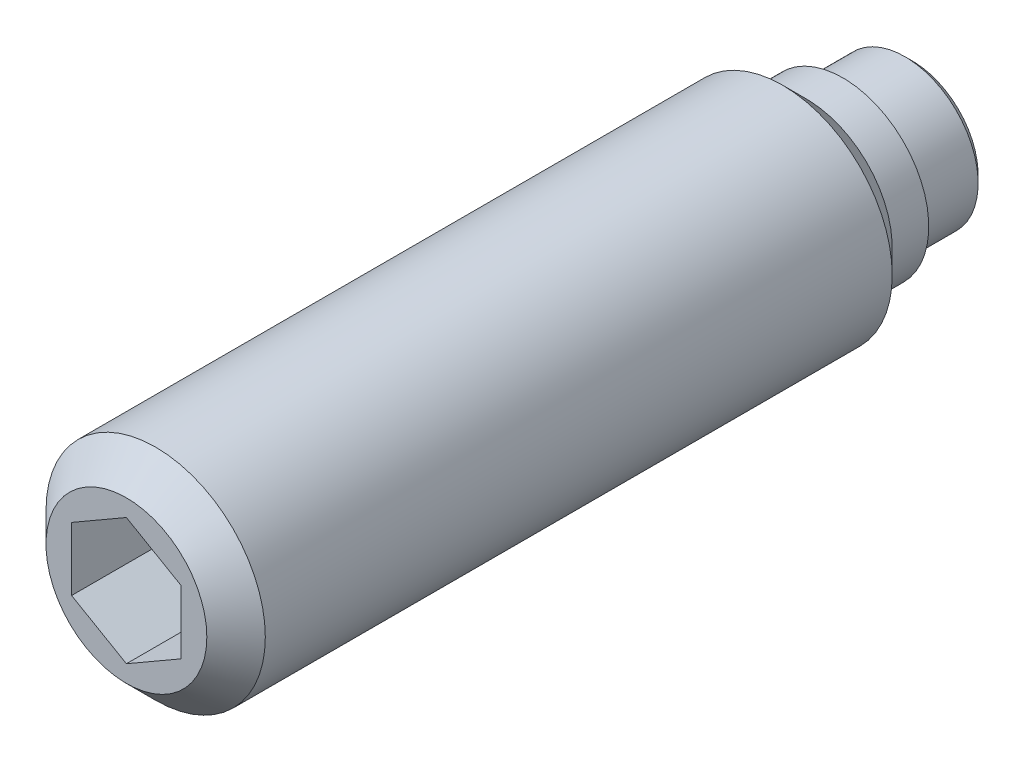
ISO-10303-21;
HEADER;
FILE_DESCRIPTION(('STEP AP214'),'2;1');
FILE_NAME('part.step','',(''),(''),'','','');
FILE_SCHEMA(('AUTOMOTIVE_DESIGN { 1 0 10303 214 1 1 1 1 }'));
ENDSEC;
DATA;
#1=APPLICATION_CONTEXT('core data for automotive mechanical design processes');
#2=APPLICATION_PROTOCOL_DEFINITION('international standard','automotive_design',2000,#1);
#3=PRODUCT_CONTEXT('',#1,'mechanical');
#4=PRODUCT('Part','Part','',(#3));
#5=PRODUCT_RELATED_PRODUCT_CATEGORY('part','',(#4));
#6=PRODUCT_DEFINITION_FORMATION('','',#4);
#7=PRODUCT_DEFINITION_CONTEXT('part definition',#1,'design');
#8=PRODUCT_DEFINITION('design','',#6,#7);
#9=PRODUCT_DEFINITION_SHAPE('','',#8);
#10=(LENGTH_UNIT() NAMED_UNIT(*) SI_UNIT(.MILLI.,.METRE.));
#11=(NAMED_UNIT(*) PLANE_ANGLE_UNIT() SI_UNIT($,.RADIAN.));
#12=(NAMED_UNIT(*) SI_UNIT($,.STERADIAN.) SOLID_ANGLE_UNIT());
#13=UNCERTAINTY_MEASURE_WITH_UNIT(LENGTH_MEASURE(1.E-05),#10,'distance_accuracy_value','');
#14=(GEOMETRIC_REPRESENTATION_CONTEXT(3) GLOBAL_UNCERTAINTY_ASSIGNED_CONTEXT((#13)) GLOBAL_UNIT_ASSIGNED_CONTEXT((#10,
#11,#12)) REPRESENTATION_CONTEXT('',''));
#15=CARTESIAN_POINT('',(0.,0.,0.));
#16=DIRECTION('',(0.,0.,1.));
#17=DIRECTION('',(1.,0.,0.));
#18=AXIS2_PLACEMENT_3D('',#15,#16,#17);
#19=CARTESIAN_POINT('',(0.,2.35,1.9));
#20=DIRECTION('',(0.,0.,1.));
#21=DIRECTION('',(1.,0.,0.));
#22=AXIS2_PLACEMENT_3D('',#19,#20,#21);
#23=PLANE('',#22);
#24=CARTESIAN_POINT('',(0.,0.,1.9));
#25=DIRECTION('',(0.,0.,-1.));
#26=DIRECTION('',(-1.,0.,0.));
#27=AXIS2_PLACEMENT_3D('',#24,#25,#26);
#28=CIRCLE('',#27,2.);
#29=CARTESIAN_POINT('',(-2.,0.,1.9));
#30=VERTEX_POINT('',#29);
#31=EDGE_CURVE('E130',#30,#30,#28,.T.);
#32=ORIENTED_EDGE('',*,*,#31,.F.);
#33=EDGE_LOOP('',(#32));
#34=FACE_BOUND('',#33,.T.);
#35=CARTESIAN_POINT('',(0.,0.,1.9));
#36=DIRECTION('',(0.,0.,-1.));
#37=DIRECTION('',(-1.,0.,0.));
#38=AXIS2_PLACEMENT_3D('',#35,#36,#37);
#39=CIRCLE('',#38,2.35);
#40=CARTESIAN_POINT('',(-2.35,0.,1.9));
#41=VERTEX_POINT('',#40);
#42=EDGE_CURVE('E133',#41,#41,#39,.T.);
#43=ORIENTED_EDGE('',*,*,#42,.T.);
#44=EDGE_LOOP('',(#43));
#45=FACE_BOUND('',#44,.T.);
#46=ADVANCED_FACE('F14',(#34,#45),#23,.F.);
#47=CARTESIAN_POINT('',(0.,0.,1.9));
#48=DIRECTION('',(0.,0.,-1.));
#49=DIRECTION('',(-1.,0.,0.));
#50=AXIS2_PLACEMENT_3D('',#47,#48,#49);
#51=CYLINDRICAL_SURFACE('',#50,3.);
#52=CARTESIAN_POINT('',(0.,0.,20.7));
#53=DIRECTION('',(0.,0.,1.));
#54=DIRECTION('',(1.,0.,0.));
#55=AXIS2_PLACEMENT_3D('',#52,#53,#54);
#56=CIRCLE('',#55,3.);
#57=CARTESIAN_POINT('',(3.,0.,20.7));
#58=VERTEX_POINT('',#57);
#59=EDGE_CURVE('E9',#58,#58,#56,.F.);
#60=ORIENTED_EDGE('',*,*,#59,.T.);
#61=EDGE_LOOP('',(#60));
#62=FACE_BOUND('',#61,.T.);
#63=CARTESIAN_POINT('',(0.,0.,3.55));
#64=DIRECTION('',(0.,0.,-1.));
#65=DIRECTION('',(-1.,0.,0.));
#66=AXIS2_PLACEMENT_3D('',#63,#64,#65);
#67=CIRCLE('',#66,3.);
#68=CARTESIAN_POINT('',(-3.,0.,3.55));
#69=VERTEX_POINT('',#68);
#70=EDGE_CURVE('E139',#69,#69,#67,.T.);
#71=ORIENTED_EDGE('',*,*,#70,.F.);
#72=EDGE_LOOP('',(#71));
#73=FACE_BOUND('',#72,.T.);
#74=ADVANCED_FACE('F157',(#62,#73),#51,.T.);
#75=CARTESIAN_POINT('',(0.,0.,3.55));
#76=DIRECTION('',(0.,0.,1.));
#77=DIRECTION('',(1.,0.,0.));
#78=AXIS2_PLACEMENT_3D('',#75,#76,#77);
#79=CONICAL_SURFACE('',#78,3.,0.785398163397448);
#80=CARTESIAN_POINT('',(0.,0.,2.9));
#81=DIRECTION('',(0.,0.,-1.));
#82=DIRECTION('',(-1.,0.,0.));
#83=AXIS2_PLACEMENT_3D('',#80,#81,#82);
#84=CIRCLE('',#83,2.35);
#85=CARTESIAN_POINT('',(-2.35,0.,2.9));
#86=VERTEX_POINT('',#85);
#87=EDGE_CURVE('E136',#86,#86,#84,.T.);
#88=ORIENTED_EDGE('',*,*,#87,.F.);
#89=EDGE_LOOP('',(#88));
#90=FACE_BOUND('',#89,.T.);
#91=ORIENTED_EDGE('',*,*,#70,.T.);
#92=EDGE_LOOP('',(#91));
#93=FACE_BOUND('',#92,.T.);
#94=ADVANCED_FACE('F164',(#90,#93),#79,.T.);
#95=CARTESIAN_POINT('',(0.,0.,1.9));
#96=DIRECTION('',(0.,0.,-1.));
#97=DIRECTION('',(-1.,0.,0.));
#98=AXIS2_PLACEMENT_3D('',#95,#96,#97);
#99=CYLINDRICAL_SURFACE('',#98,2.35);
#100=ORIENTED_EDGE('',*,*,#42,.F.);
#101=EDGE_LOOP('',(#100));
#102=FACE_BOUND('',#101,.T.);
#103=ORIENTED_EDGE('',*,*,#87,.T.);
#104=EDGE_LOOP('',(#103));
#105=FACE_BOUND('',#104,.T.);
#106=ADVANCED_FACE('F172',(#102,#105),#99,.T.);
#107=CARTESIAN_POINT('',(0.,0.,-0.8));
#108=DIRECTION('',(0.,0.,-1.));
#109=DIRECTION('',(-1.,0.,0.));
#110=AXIS2_PLACEMENT_3D('',#107,#108,#109);
#111=CYLINDRICAL_SURFACE('',#110,2.);
#112=CARTESIAN_POINT('',(0.,0.,0.2));
#113=DIRECTION('',(0.,0.,-1.));
#114=DIRECTION('',(-1.,0.,0.));
#115=AXIS2_PLACEMENT_3D('',#112,#113,#114);
#116=CIRCLE('',#115,2.);
#117=CARTESIAN_POINT('',(-2.,0.,0.2));
#118=VERTEX_POINT('',#117);
#119=EDGE_CURVE('E127',#118,#118,#116,.T.);
#120=ORIENTED_EDGE('',*,*,#119,.F.);
#121=EDGE_LOOP('',(#120));
#122=FACE_BOUND('',#121,.T.);
#123=ORIENTED_EDGE('',*,*,#31,.T.);
#124=EDGE_LOOP('',(#123));
#125=FACE_BOUND('',#124,.T.);
#126=ADVANCED_FACE('F170',(#122,#125),#111,.T.);
#127=CARTESIAN_POINT('',(0.,0.,0.2));
#128=DIRECTION('',(0.,0.,1.));
#129=DIRECTION('',(1.,0.,0.));
#130=AXIS2_PLACEMENT_3D('',#127,#128,#129);
#131=CONICAL_SURFACE('',#130,2.,0.785398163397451);
#132=CARTESIAN_POINT('',(0.,0.,0.));
#133=DIRECTION('',(0.,0.,-1.));
#134=DIRECTION('',(-1.,0.,0.));
#135=AXIS2_PLACEMENT_3D('',#132,#133,#134);
#136=CIRCLE('',#135,1.8);
#137=CARTESIAN_POINT('',(-1.8,0.,0.));
#138=VERTEX_POINT('',#137);
#139=EDGE_CURVE('E124',#138,#138,#136,.T.);
#140=ORIENTED_EDGE('',*,*,#139,.F.);
#141=EDGE_LOOP('',(#140));
#142=FACE_BOUND('',#141,.T.);
#143=ORIENTED_EDGE('',*,*,#119,.T.);
#144=EDGE_LOOP('',(#143));
#145=FACE_BOUND('',#144,.T.);
#146=ADVANCED_FACE('F204',(#142,#145),#131,.T.);
#147=CARTESIAN_POINT('',(0.,1.8,0.));
#148=DIRECTION('',(0.,0.,1.));
#149=DIRECTION('',(1.,0.,0.));
#150=AXIS2_PLACEMENT_3D('',#147,#148,#149);
#151=PLANE('',#150);
#152=CARTESIAN_POINT('',(0.,0.,0.));
#153=DIRECTION('',(0.,0.,-1.));
#154=DIRECTION('',(-1.,0.,0.));
#155=AXIS2_PLACEMENT_3D('',#152,#153,#154);
#156=CIRCLE('',#155,0.8);
#157=CARTESIAN_POINT('',(-0.8,0.,0.));
#158=VERTEX_POINT('',#157);
#159=EDGE_CURVE('E114',#158,#158,#156,.T.);
#160=ORIENTED_EDGE('',*,*,#159,.F.);
#161=EDGE_LOOP('',(#160));
#162=FACE_BOUND('',#161,.T.);
#163=ORIENTED_EDGE('',*,*,#139,.T.);
#164=EDGE_LOOP('',(#163));
#165=FACE_BOUND('',#164,.T.);
#166=ADVANCED_FACE('F212',(#162,#165),#151,.F.);
#167=CARTESIAN_POINT('',(0.,0.,0.));
#168=DIRECTION('',(0.,0.,1.));
#169=DIRECTION('',(1.,0.,0.));
#170=AXIS2_PLACEMENT_3D('',#167,#168,#169);
#171=CONICAL_SURFACE('',#170,0.8,0.785398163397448);
#172=CARTESIAN_POINT('',(0.,0.,-0.8));
#173=VERTEX_POINT('',#172);
#174=VERTEX_LOOP('',#173);
#175=FACE_BOUND('',#174,.T.);
#176=ORIENTED_EDGE('',*,*,#159,.T.);
#177=EDGE_LOOP('',(#176));
#178=FACE_BOUND('',#177,.T.);
#179=ADVANCED_FACE('F220',(#175,#178),#171,.T.);
#180=CARTESIAN_POINT('',(0.,0.,21.5));
#181=DIRECTION('',(0.,0.,1.));
#182=DIRECTION('',(1.,0.,0.));
#183=AXIS2_PLACEMENT_3D('',#180,#181,#182);
#184=PLANE('',#183);
#185=CARTESIAN_POINT('',(0.,0.,21.5));
#186=DIRECTION('',(0.,0.,1.));
#187=DIRECTION('',(1.,0.,0.));
#188=AXIS2_PLACEMENT_3D('',#185,#186,#187);
#189=CIRCLE('',#188,2.2);
#190=CARTESIAN_POINT('',(2.2,0.,21.5));
#191=VERTEX_POINT('',#190);
#192=EDGE_CURVE('E22',#191,#191,#189,.T.);
#193=ORIENTED_EDGE('',*,*,#192,.T.);
#194=EDGE_LOOP('',(#193));
#195=FACE_BOUND('',#194,.T.);
#196=DIRECTION('',(-0.866025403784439,0.5,0.));
#197=VECTOR('',#196,1.);
#198=CARTESIAN_POINT('',(1.5,0.86602540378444,21.5));
#199=LINE('',#198,#197);
#200=CARTESIAN_POINT('',(1.5,0.86602540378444,21.5));
#201=VERTEX_POINT('',#200);
#202=CARTESIAN_POINT('',(0.,1.73205080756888,21.5));
#203=VERTEX_POINT('',#202);
#204=EDGE_CURVE('E29',#201,#203,#199,.T.);
#205=ORIENTED_EDGE('',*,*,#204,.F.);
#206=DIRECTION('',(0.,1.,0.));
#207=VECTOR('',#206,1.);
#208=CARTESIAN_POINT('',(1.5,-0.866025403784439,21.5));
#209=LINE('',#208,#207);
#210=CARTESIAN_POINT('',(1.5,-0.866025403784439,21.5));
#211=VERTEX_POINT('',#210);
#212=EDGE_CURVE('E88',#211,#201,#209,.T.);
#213=ORIENTED_EDGE('',*,*,#212,.F.);
#214=DIRECTION('',(0.866025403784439,0.5,0.));
#215=VECTOR('',#214,1.);
#216=CARTESIAN_POINT('',(0.,-1.73205080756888,21.5));
#217=LINE('',#216,#215);
#218=CARTESIAN_POINT('',(0.,-1.73205080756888,21.5));
#219=VERTEX_POINT('',#218);
#220=EDGE_CURVE('E91',#219,#211,#217,.T.);
#221=ORIENTED_EDGE('',*,*,#220,.F.);
#222=DIRECTION('',(0.866025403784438,-0.5,0.));
#223=VECTOR('',#222,1.);
#224=CARTESIAN_POINT('',(-1.5,-0.866025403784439,21.5));
#225=LINE('',#224,#223);
#226=CARTESIAN_POINT('',(-1.5,-0.866025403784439,21.5));
#227=VERTEX_POINT('',#226);
#228=EDGE_CURVE('E107',#227,#219,#225,.T.);
#229=ORIENTED_EDGE('',*,*,#228,.F.);
#230=DIRECTION('',(0.,-1.,0.));
#231=VECTOR('',#230,1.);
#232=CARTESIAN_POINT('',(-1.5,0.866025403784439,21.5));
#233=LINE('',#232,#231);
#234=CARTESIAN_POINT('',(-1.5,0.866025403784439,21.5));
#235=VERTEX_POINT('',#234);
#236=EDGE_CURVE('E104',#235,#227,#233,.T.);
#237=ORIENTED_EDGE('',*,*,#236,.F.);
#238=DIRECTION('',(-0.866025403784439,-0.5,0.));
#239=VECTOR('',#238,1.);
#240=CARTESIAN_POINT('',(0.,1.73205080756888,21.5));
#241=LINE('',#240,#239);
#242=EDGE_CURVE('E102',#203,#235,#241,.T.);
#243=ORIENTED_EDGE('',*,*,#242,.F.);
#244=EDGE_LOOP('',(#205,#213,#221,#229,#237,#243));
#245=FACE_BOUND('',#244,.T.);
#246=ADVANCED_FACE('F144',(#195,#245),#184,.T.);
#247=CARTESIAN_POINT('',(1.5,0.86602540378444,18.));
#248=DIRECTION('',(0.5,0.866025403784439,0.));
#249=DIRECTION('',(-0.866025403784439,0.5,0.));
#250=AXIS2_PLACEMENT_3D('',#247,#248,#249);
#251=PLANE('',#250);
#252=ORIENTED_EDGE('',*,*,#204,.T.);
#253=DIRECTION('',(0.,0.,1.));
#254=VECTOR('',#253,1.);
#255=CARTESIAN_POINT('',(0.,1.73205080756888,18.));
#256=LINE('',#255,#254);
#257=CARTESIAN_POINT('',(0.,1.73205080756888,18.));
#258=VERTEX_POINT('',#257);
#259=EDGE_CURVE('E65',#258,#203,#256,.T.);
#260=ORIENTED_EDGE('',*,*,#259,.F.);
#261=DIRECTION('',(-0.866025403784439,0.5,0.));
#262=VECTOR('',#261,1.);
#263=CARTESIAN_POINT('',(1.5,0.86602540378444,18.));
#264=LINE('',#263,#262);
#265=CARTESIAN_POINT('',(1.5,0.86602540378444,18.));
#266=VERTEX_POINT('',#265);
#267=EDGE_CURVE('E69',#266,#258,#264,.T.);
#268=ORIENTED_EDGE('',*,*,#267,.F.);
#269=DIRECTION('',(0.,0.,1.));
#270=VECTOR('',#269,1.);
#271=CARTESIAN_POINT('',(1.5,0.86602540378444,18.));
#272=LINE('',#271,#270);
#273=EDGE_CURVE('E112',#266,#201,#272,.T.);
#274=ORIENTED_EDGE('',*,*,#273,.T.);
#275=EDGE_LOOP('',(#252,#260,#268,#274));
#276=FACE_BOUND('',#275,.T.);
#277=ADVANCED_FACE('F67',(#276),#251,.F.);
#278=CARTESIAN_POINT('',(1.5,-0.866025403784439,18.));
#279=DIRECTION('',(1.,0.,0.));
#280=DIRECTION('',(0.,0.,-1.));
#281=AXIS2_PLACEMENT_3D('',#278,#279,#280);
#282=PLANE('',#281);
#283=ORIENTED_EDGE('',*,*,#212,.T.);
#284=ORIENTED_EDGE('',*,*,#273,.F.);
#285=DIRECTION('',(0.,1.,0.));
#286=VECTOR('',#285,1.);
#287=CARTESIAN_POINT('',(1.5,-0.866025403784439,18.));
#288=LINE('',#287,#286);
#289=CARTESIAN_POINT('',(1.5,-0.866025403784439,18.));
#290=VERTEX_POINT('',#289);
#291=EDGE_CURVE('E75',#290,#266,#288,.T.);
#292=ORIENTED_EDGE('',*,*,#291,.F.);
#293=DIRECTION('',(0.,0.,1.));
#294=VECTOR('',#293,1.);
#295=CARTESIAN_POINT('',(1.5,-0.866025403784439,18.));
#296=LINE('',#295,#294);
#297=EDGE_CURVE('E115',#290,#211,#296,.T.);
#298=ORIENTED_EDGE('',*,*,#297,.T.);
#299=EDGE_LOOP('',(#283,#284,#292,#298));
#300=FACE_BOUND('',#299,.T.);
#301=ADVANCED_FACE('F243',(#300),#282,.F.);
#302=CARTESIAN_POINT('',(0.,-1.73205080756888,18.));
#303=DIRECTION('',(0.5,-0.866025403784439,0.));
#304=DIRECTION('',(0.866025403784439,0.5,0.));
#305=AXIS2_PLACEMENT_3D('',#302,#303,#304);
#306=PLANE('',#305);
#307=ORIENTED_EDGE('',*,*,#220,.T.);
#308=ORIENTED_EDGE('',*,*,#297,.F.);
#309=DIRECTION('',(0.866025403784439,0.5,0.));
#310=VECTOR('',#309,1.);
#311=CARTESIAN_POINT('',(0.,-1.73205080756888,18.));
#312=LINE('',#311,#310);
#313=CARTESIAN_POINT('',(0.,-1.73205080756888,18.));
#314=VERTEX_POINT('',#313);
#315=EDGE_CURVE('E98',#314,#290,#312,.T.);
#316=ORIENTED_EDGE('',*,*,#315,.F.);
#317=DIRECTION('',(0.,0.,1.));
#318=VECTOR('',#317,1.);
#319=CARTESIAN_POINT('',(0.,-1.73205080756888,18.));
#320=LINE('',#319,#318);
#321=EDGE_CURVE('E117',#314,#219,#320,.T.);
#322=ORIENTED_EDGE('',*,*,#321,.T.);
#323=EDGE_LOOP('',(#307,#308,#316,#322));
#324=FACE_BOUND('',#323,.T.);
#325=ADVANCED_FACE('F251',(#324),#306,.F.);
#326=CARTESIAN_POINT('',(-1.5,-0.866025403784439,18.));
#327=DIRECTION('',(-0.5,-0.866025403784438,0.));
#328=DIRECTION('',(0.866025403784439,-0.5,0.));
#329=AXIS2_PLACEMENT_3D('',#326,#327,#328);
#330=PLANE('',#329);
#331=ORIENTED_EDGE('',*,*,#228,.T.);
#332=ORIENTED_EDGE('',*,*,#321,.F.);
#333=DIRECTION('',(0.866025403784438,-0.5,0.));
#334=VECTOR('',#333,1.);
#335=CARTESIAN_POINT('',(-1.5,-0.866025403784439,18.));
#336=LINE('',#335,#334);
#337=CARTESIAN_POINT('',(-1.5,-0.866025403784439,18.));
#338=VERTEX_POINT('',#337);
#339=EDGE_CURVE('E95',#338,#314,#336,.T.);
#340=ORIENTED_EDGE('',*,*,#339,.F.);
#341=DIRECTION('',(0.,0.,1.));
#342=VECTOR('',#341,1.);
#343=CARTESIAN_POINT('',(-1.5,-0.866025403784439,18.));
#344=LINE('',#343,#342);
#345=EDGE_CURVE('E119',#338,#227,#344,.T.);
#346=ORIENTED_EDGE('',*,*,#345,.T.);
#347=EDGE_LOOP('',(#331,#332,#340,#346));
#348=FACE_BOUND('',#347,.T.);
#349=ADVANCED_FACE('F260',(#348),#330,.F.);
#350=CARTESIAN_POINT('',(-1.5,0.866025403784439,18.));
#351=DIRECTION('',(-1.,0.,0.));
#352=DIRECTION('',(0.,-1.,0.));
#353=AXIS2_PLACEMENT_3D('',#350,#351,#352);
#354=PLANE('',#353);
#355=ORIENTED_EDGE('',*,*,#236,.T.);
#356=ORIENTED_EDGE('',*,*,#345,.F.);
#357=DIRECTION('',(0.,-1.,0.));
#358=VECTOR('',#357,1.);
#359=CARTESIAN_POINT('',(-1.5,0.866025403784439,18.));
#360=LINE('',#359,#358);
#361=CARTESIAN_POINT('',(-1.5,0.866025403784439,18.));
#362=VERTEX_POINT('',#361);
#363=EDGE_CURVE('E83',#362,#338,#360,.T.);
#364=ORIENTED_EDGE('',*,*,#363,.F.);
#365=DIRECTION('',(0.,0.,1.));
#366=VECTOR('',#365,1.);
#367=CARTESIAN_POINT('',(-1.5,0.866025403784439,18.));
#368=LINE('',#367,#366);
#369=EDGE_CURVE('E74',#362,#235,#368,.T.);
#370=ORIENTED_EDGE('',*,*,#369,.T.);
#371=EDGE_LOOP('',(#355,#356,#364,#370));
#372=FACE_BOUND('',#371,.T.);
#373=ADVANCED_FACE('F269',(#372),#354,.F.);
#374=CARTESIAN_POINT('',(0.,1.73205080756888,18.));
#375=DIRECTION('',(-0.5,0.866025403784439,0.));
#376=DIRECTION('',(-0.866025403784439,-0.5,0.));
#377=AXIS2_PLACEMENT_3D('',#374,#375,#376);
#378=PLANE('',#377);
#379=ORIENTED_EDGE('',*,*,#242,.T.);
#380=ORIENTED_EDGE('',*,*,#369,.F.);
#381=DIRECTION('',(-0.866025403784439,-0.5,0.));
#382=VECTOR('',#381,1.);
#383=CARTESIAN_POINT('',(0.,1.73205080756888,18.));
#384=LINE('',#383,#382);
#385=EDGE_CURVE('E78',#258,#362,#384,.T.);
#386=ORIENTED_EDGE('',*,*,#385,.F.);
#387=ORIENTED_EDGE('',*,*,#259,.T.);
#388=EDGE_LOOP('',(#379,#380,#386,#387));
#389=FACE_BOUND('',#388,.T.);
#390=ADVANCED_FACE('F79',(#389),#378,.F.);
#391=CARTESIAN_POINT('',(0.,0.,18.));
#392=DIRECTION('',(0.,0.,1.));
#393=DIRECTION('',(1.,0.,0.));
#394=AXIS2_PLACEMENT_3D('',#391,#392,#393);
#395=PLANE('',#394);
#396=ORIENTED_EDGE('',*,*,#267,.T.);
#397=ORIENTED_EDGE('',*,*,#385,.T.);
#398=ORIENTED_EDGE('',*,*,#363,.T.);
#399=ORIENTED_EDGE('',*,*,#339,.T.);
#400=ORIENTED_EDGE('',*,*,#315,.T.);
#401=ORIENTED_EDGE('',*,*,#291,.T.);
#402=EDGE_LOOP('',(#396,#397,#398,#399,#400,#401));
#403=FACE_BOUND('',#402,.T.);
#404=ADVANCED_FACE('F85',(#403),#395,.T.);
#405=CARTESIAN_POINT('',(0.,0.,21.5));
#406=DIRECTION('',(0.,0.,-1.));
#407=DIRECTION('',(-1.,0.,0.));
#408=AXIS2_PLACEMENT_3D('',#405,#406,#407);
#409=CONICAL_SURFACE('',#408,2.2,0.785398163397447);
#410=ORIENTED_EDGE('',*,*,#59,.F.);
#411=EDGE_LOOP('',(#410));
#412=FACE_BOUND('',#411,.T.);
#413=ORIENTED_EDGE('',*,*,#192,.F.);
#414=EDGE_LOOP('',(#413));
#415=FACE_BOUND('',#414,.T.);
#416=ADVANCED_FACE('F16',(#412,#415),#409,.T.);
#417=CLOSED_SHELL('',(#46,#74,#94,#106,#126,#146,#166,#179,#246,#277,#301,#325,#349,#373,#390,
#404,#416));
#418=MANIFOLD_SOLID_BREP('B1',#417);
#419=ADVANCED_BREP_SHAPE_REPRESENTATION('',(#18,#418),#14);
#420=SHAPE_DEFINITION_REPRESENTATION(#9,#419);
ENDSEC;
END-ISO-10303-21;
